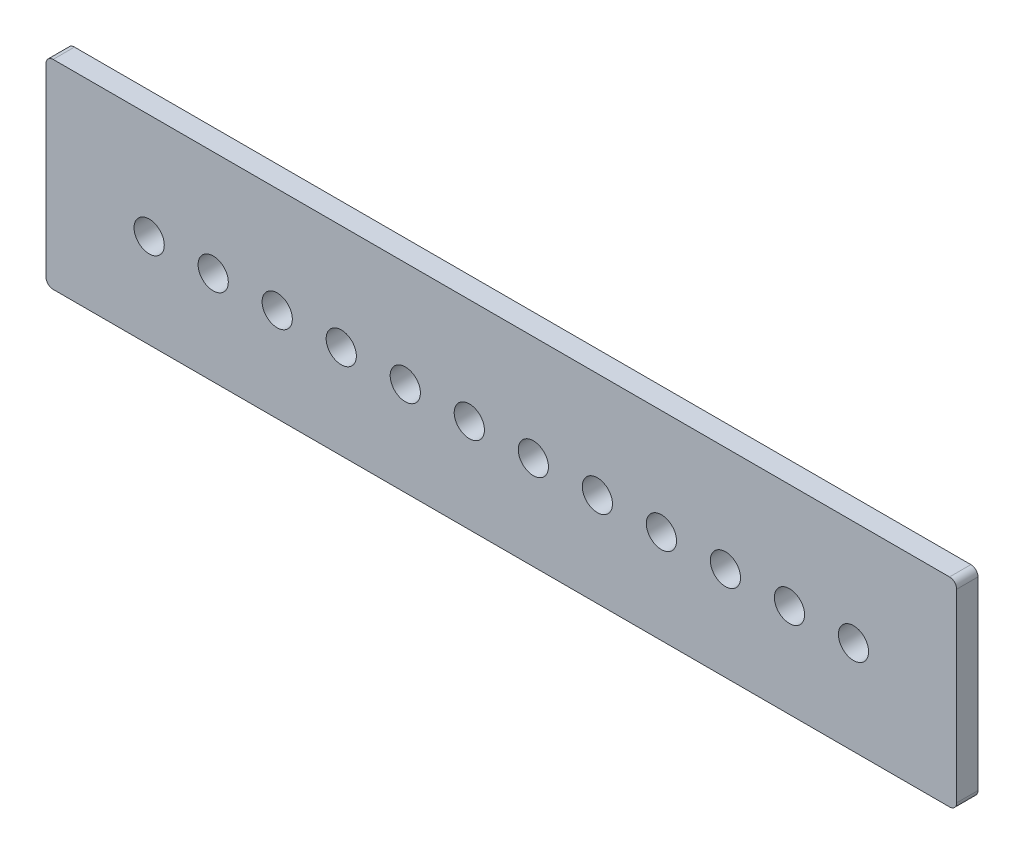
from build123d import *

# Parameters (mm, degrees)
SKETCH1_W           = 406.4
SKETCH1_H           = 88.9
BOSS_EXTRUDE1_DEPTH = 9.525
SKETCH2_R           = 6.7437
CUT_EXTRUDE1_DEPTH  = 417.118847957
LPATTERN1_COUNT     = 12
LPATTERN1_PITCH     = 28.575
FILLET1_R           = 3.175


with BuildPart() as part:
    # Sketch1 → Boss-Extrude1 (new body)
    with BuildSketch(Plane.XY):
        with Locations((203.2, 44.45)):
            Rectangle(SKETCH1_W, SKETCH1_H)
    extrude(amount=BOSS_EXTRUDE1_DEPTH)

    # Sketch2 → Cut-Extrude1 (cut, through all)
    with BuildSketch(Plane.XY.offset(9.525)):
        with Locations((46.0375, 41.91)):
            Circle(SKETCH2_R)
    cut_extrude1 = extrude(amount=-CUT_EXTRUDE1_DEPTH, mode=Mode.SUBTRACT)

    # LPattern1: Cut-Extrude1 ×12
    with Locations(*[(i * LPATTERN1_PITCH, 0, 0) for i in range(1, LPATTERN1_COUNT)]):
        add(cut_extrude1, mode=Mode.SUBTRACT)

    # Fillet1
    fillet1_edges = [part.edges().sort_by_distance(p)[0] for p in [
        (0, 88.9, 4.7625),
        (406.4, 88.9, 4.7625),
        (406.4, 0, 4.7625),
        (0, 0, 4.7625),
    ]]
    fillet(fillet1_edges, radius=FILLET1_R)


solid = part.part
